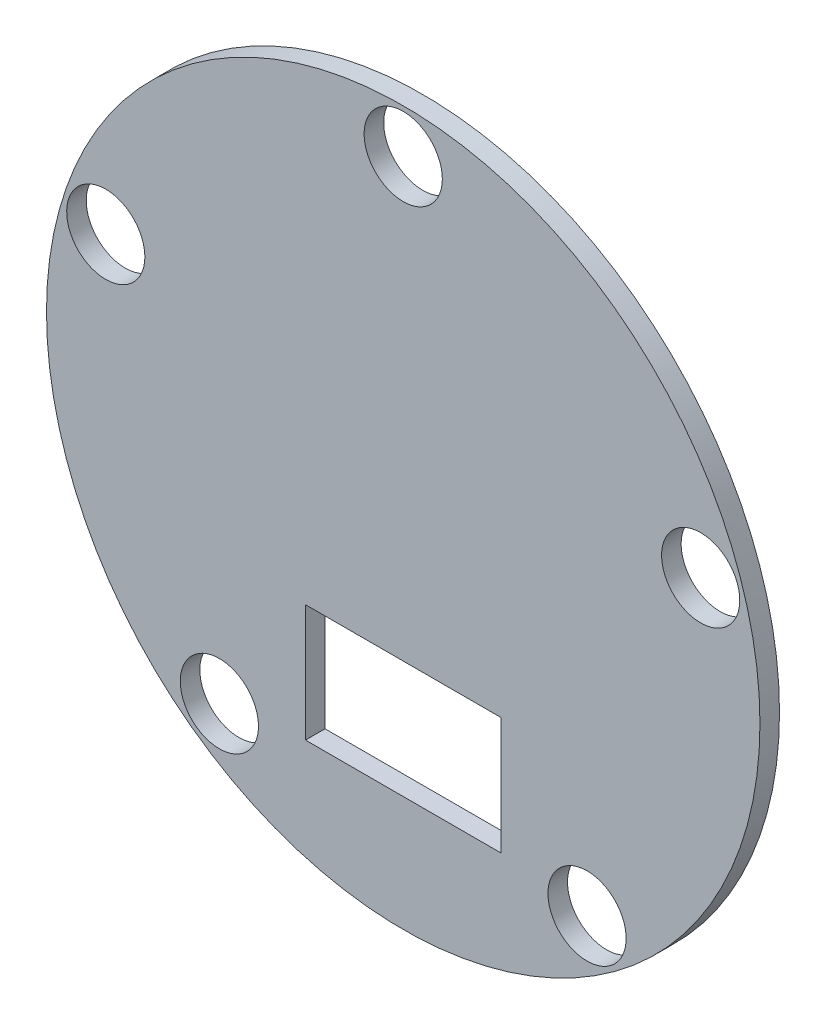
ISO-10303-21;
HEADER;
FILE_DESCRIPTION(('STEP AP214'),'2;1');
FILE_NAME('part.step','',(''),(''),'','','');
FILE_SCHEMA(('AUTOMOTIVE_DESIGN { 1 0 10303 214 1 1 1 1 }'));
ENDSEC;
DATA;
#1=APPLICATION_CONTEXT('core data for automotive mechanical design processes');
#2=APPLICATION_PROTOCOL_DEFINITION('international standard','automotive_design',2000,#1);
#3=PRODUCT_CONTEXT('',#1,'mechanical');
#4=PRODUCT('Part','Part','',(#3));
#5=PRODUCT_RELATED_PRODUCT_CATEGORY('part','',(#4));
#6=PRODUCT_DEFINITION_FORMATION('','',#4);
#7=PRODUCT_DEFINITION_CONTEXT('part definition',#1,'design');
#8=PRODUCT_DEFINITION('design','',#6,#7);
#9=PRODUCT_DEFINITION_SHAPE('','',#8);
#10=(LENGTH_UNIT() NAMED_UNIT(*) SI_UNIT(.MILLI.,.METRE.));
#11=(NAMED_UNIT(*) PLANE_ANGLE_UNIT() SI_UNIT($,.RADIAN.));
#12=(NAMED_UNIT(*) SI_UNIT($,.STERADIAN.) SOLID_ANGLE_UNIT());
#13=UNCERTAINTY_MEASURE_WITH_UNIT(LENGTH_MEASURE(1.E-05),#10,'distance_accuracy_value','');
#14=(GEOMETRIC_REPRESENTATION_CONTEXT(3) GLOBAL_UNCERTAINTY_ASSIGNED_CONTEXT((#13)) GLOBAL_UNIT_ASSIGNED_CONTEXT((#10,
#11,#12)) REPRESENTATION_CONTEXT('',''));
#15=CARTESIAN_POINT('',(0.,0.,0.));
#16=DIRECTION('',(0.,0.,1.));
#17=DIRECTION('',(1.,0.,0.));
#18=AXIS2_PLACEMENT_3D('',#15,#16,#17);
#19=CARTESIAN_POINT('',(0.,0.,6.35));
#20=DIRECTION('',(0.,0.,-1.));
#21=DIRECTION('',(-1.,0.,0.));
#22=AXIS2_PLACEMENT_3D('',#19,#20,#21);
#23=CYLINDRICAL_SURFACE('',#22,115.8875);
#24=CARTESIAN_POINT('',(0.,0.,6.35));
#25=DIRECTION('',(0.,0.,1.));
#26=DIRECTION('',(1.,0.,0.));
#27=AXIS2_PLACEMENT_3D('',#24,#25,#26);
#28=CIRCLE('',#27,115.8875);
#29=CARTESIAN_POINT('',(115.8875,0.,6.35));
#30=VERTEX_POINT('',#29);
#31=EDGE_CURVE('E13',#30,#30,#28,.T.);
#32=ORIENTED_EDGE('',*,*,#31,.F.);
#33=EDGE_LOOP('',(#32));
#34=FACE_BOUND('',#33,.T.);
#35=CARTESIAN_POINT('',(0.,0.,0.));
#36=DIRECTION('',(0.,0.,1.));
#37=DIRECTION('',(1.,0.,0.));
#38=AXIS2_PLACEMENT_3D('',#35,#36,#37);
#39=CIRCLE('',#38,115.8875);
#40=CARTESIAN_POINT('',(115.8875,0.,0.));
#41=VERTEX_POINT('',#40);
#42=EDGE_CURVE('E53',#41,#41,#39,.T.);
#43=ORIENTED_EDGE('',*,*,#42,.T.);
#44=EDGE_LOOP('',(#43));
#45=FACE_BOUND('',#44,.T.);
#46=ADVANCED_FACE('F50',(#34,#45),#23,.T.);
#47=CARTESIAN_POINT('',(0.,0.,6.35));
#48=DIRECTION('',(0.,0.,1.));
#49=DIRECTION('',(1.,0.,0.));
#50=AXIS2_PLACEMENT_3D('',#47,#48,#49);
#51=PLANE('',#50);
#52=DIRECTION('',(0.,-1.,0.));
#53=VECTOR('',#52,1.);
#54=CARTESIAN_POINT('',(-31.75,-40.3542301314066,6.35));
#55=LINE('',#54,#53);
#56=CARTESIAN_POINT('',(-31.75,-40.3542301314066,6.35));
#57=VERTEX_POINT('',#56);
#58=CARTESIAN_POINT('',(-31.75,-78.4542301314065,6.35));
#59=VERTEX_POINT('',#58);
#60=EDGE_CURVE('E68',#57,#59,#55,.T.);
#61=ORIENTED_EDGE('',*,*,#60,.F.);
#62=DIRECTION('',(-1.,0.,0.));
#63=VECTOR('',#62,1.);
#64=CARTESIAN_POINT('',(-31.75,-40.3542301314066,6.35));
#65=LINE('',#64,#63);
#66=CARTESIAN_POINT('',(31.75,-40.3542301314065,6.35));
#67=VERTEX_POINT('',#66);
#68=EDGE_CURVE('E118',#67,#57,#65,.T.);
#69=ORIENTED_EDGE('',*,*,#68,.F.);
#70=DIRECTION('',(0.,1.,0.));
#71=VECTOR('',#70,1.);
#72=CARTESIAN_POINT('',(31.75,-40.3542301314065,6.35));
#73=LINE('',#72,#71);
#74=CARTESIAN_POINT('',(31.75,-78.4542301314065,6.35));
#75=VERTEX_POINT('',#74);
#76=EDGE_CURVE('E123',#75,#67,#73,.T.);
#77=ORIENTED_EDGE('',*,*,#76,.F.);
#78=DIRECTION('',(1.,0.,0.));
#79=VECTOR('',#78,1.);
#80=CARTESIAN_POINT('',(-31.75,-78.4542301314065,6.35));
#81=LINE('',#80,#79);
#82=EDGE_CURVE('E131',#59,#75,#81,.T.);
#83=ORIENTED_EDGE('',*,*,#82,.F.);
#84=EDGE_LOOP('',(#61,#69,#77,#83));
#85=FACE_BOUND('',#84,.T.);
#86=CARTESIAN_POINT('',(-96.6273420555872,31.3961266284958,6.35));
#87=DIRECTION('',(0.,0.,1.));
#88=DIRECTION('',(0.309016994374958,0.95105651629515,0.));
#89=AXIS2_PLACEMENT_3D('',#86,#87,#88);
#90=CIRCLE('',#89,12.7);
#91=CARTESIAN_POINT('',(-92.7028262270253,43.4745443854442,6.35));
#92=VERTEX_POINT('',#91);
#93=EDGE_CURVE('E139',#92,#92,#90,.T.);
#94=ORIENTED_EDGE('',*,*,#93,.F.);
#95=EDGE_LOOP('',(#94));
#96=FACE_BOUND('',#95,.T.);
#97=CARTESIAN_POINT('',(-59.718981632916,-82.1961266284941,6.35));
#98=DIRECTION('',(0.,0.,1.));
#99=DIRECTION('',(-0.809016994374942,0.58778525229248,0.));
#100=AXIS2_PLACEMENT_3D('',#97,#98,#99);
#101=CIRCLE('',#100,12.7);
#102=CARTESIAN_POINT('',(-69.9934974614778,-74.7312539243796,6.35));
#103=VERTEX_POINT('',#102);
#104=EDGE_CURVE('E148',#103,#103,#101,.T.);
#105=ORIENTED_EDGE('',*,*,#104,.F.);
#106=EDGE_LOOP('',(#105));
#107=FACE_BOUND('',#106,.T.);
#108=CARTESIAN_POINT('',(59.7189816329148,-82.196126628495,6.35));
#109=DIRECTION('',(0.,0.,1.));
#110=DIRECTION('',(-0.809016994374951,-0.587785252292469,0.));
#111=AXIS2_PLACEMENT_3D('',#108,#109,#110);
#112=CIRCLE('',#111,12.7);
#113=CARTESIAN_POINT('',(49.4444658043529,-89.6609993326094,6.35));
#114=VERTEX_POINT('',#113);
#115=EDGE_CURVE('E155',#114,#114,#112,.T.);
#116=ORIENTED_EDGE('',*,*,#115,.F.);
#117=EDGE_LOOP('',(#116));
#118=FACE_BOUND('',#117,.T.);
#119=CARTESIAN_POINT('',(96.6273420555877,31.3961266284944,6.35));
#120=DIRECTION('',(0.,0.,1.));
#121=DIRECTION('',(0.309016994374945,-0.951056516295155,0.));
#122=AXIS2_PLACEMENT_3D('',#119,#120,#121);
#123=CIRCLE('',#122,12.7);
#124=CARTESIAN_POINT('',(100.55185788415,19.3177088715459,6.35));
#125=VERTEX_POINT('',#124);
#126=EDGE_CURVE('E163',#125,#125,#123,.T.);
#127=ORIENTED_EDGE('',*,*,#126,.F.);
#128=EDGE_LOOP('',(#127));
#129=FACE_BOUND('',#128,.T.);
#130=CARTESIAN_POINT('',(0.,101.6,6.35));
#131=DIRECTION('',(0.,0.,1.));
#132=DIRECTION('',(1.,0.,0.));
#133=AXIS2_PLACEMENT_3D('',#130,#131,#132);
#134=CIRCLE('',#133,12.7);
#135=CARTESIAN_POINT('',(12.7,101.6,6.35));
#136=VERTEX_POINT('',#135);
#137=EDGE_CURVE('E170',#136,#136,#134,.T.);
#138=ORIENTED_EDGE('',*,*,#137,.F.);
#139=EDGE_LOOP('',(#138));
#140=FACE_BOUND('',#139,.T.);
#141=ORIENTED_EDGE('',*,*,#31,.T.);
#142=EDGE_LOOP('',(#141));
#143=FACE_BOUND('',#142,.T.);
#144=ADVANCED_FACE('F181',(#85,#96,#107,#118,#129,#140,#143),#51,.T.);
#145=CARTESIAN_POINT('',(0.,0.,0.));
#146=DIRECTION('',(0.,0.,1.));
#147=DIRECTION('',(1.,0.,0.));
#148=AXIS2_PLACEMENT_3D('',#145,#146,#147);
#149=PLANE('',#148);
#150=DIRECTION('',(-1.,0.,0.));
#151=VECTOR('',#150,1.);
#152=CARTESIAN_POINT('',(-31.75,-40.3542301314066,0.));
#153=LINE('',#152,#151);
#154=CARTESIAN_POINT('',(31.75,-40.3542301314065,0.));
#155=VERTEX_POINT('',#154);
#156=CARTESIAN_POINT('',(-31.75,-40.3542301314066,0.));
#157=VERTEX_POINT('',#156);
#158=EDGE_CURVE('E106',#155,#157,#153,.T.);
#159=ORIENTED_EDGE('',*,*,#158,.T.);
#160=DIRECTION('',(0.,-1.,0.));
#161=VECTOR('',#160,1.);
#162=CARTESIAN_POINT('',(-31.75,-40.3542301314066,0.));
#163=LINE('',#162,#161);
#164=CARTESIAN_POINT('',(-31.75,-78.4542301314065,0.));
#165=VERTEX_POINT('',#164);
#166=EDGE_CURVE('E99',#157,#165,#163,.T.);
#167=ORIENTED_EDGE('',*,*,#166,.T.);
#168=DIRECTION('',(1.,0.,0.));
#169=VECTOR('',#168,1.);
#170=CARTESIAN_POINT('',(-31.75,-78.4542301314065,0.));
#171=LINE('',#170,#169);
#172=CARTESIAN_POINT('',(31.75,-78.4542301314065,0.));
#173=VERTEX_POINT('',#172);
#174=EDGE_CURVE('E109',#165,#173,#171,.T.);
#175=ORIENTED_EDGE('',*,*,#174,.T.);
#176=DIRECTION('',(0.,1.,0.));
#177=VECTOR('',#176,1.);
#178=CARTESIAN_POINT('',(31.75,-40.3542301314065,0.));
#179=LINE('',#178,#177);
#180=EDGE_CURVE('E78',#173,#155,#179,.T.);
#181=ORIENTED_EDGE('',*,*,#180,.T.);
#182=EDGE_LOOP('',(#159,#167,#175,#181));
#183=FACE_BOUND('',#182,.T.);
#184=CARTESIAN_POINT('',(-96.6273420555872,31.3961266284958,0.));
#185=DIRECTION('',(0.,0.,1.));
#186=DIRECTION('',(0.309016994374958,0.95105651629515,0.));
#187=AXIS2_PLACEMENT_3D('',#184,#185,#186);
#188=CIRCLE('',#187,12.7);
#189=CARTESIAN_POINT('',(-92.7028262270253,43.4745443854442,0.));
#190=VERTEX_POINT('',#189);
#191=EDGE_CURVE('E145',#190,#190,#188,.T.);
#192=ORIENTED_EDGE('',*,*,#191,.T.);
#193=EDGE_LOOP('',(#192));
#194=FACE_BOUND('',#193,.T.);
#195=CARTESIAN_POINT('',(-59.718981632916,-82.1961266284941,0.));
#196=DIRECTION('',(0.,0.,1.));
#197=DIRECTION('',(-0.809016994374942,0.58778525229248,0.));
#198=AXIS2_PLACEMENT_3D('',#195,#196,#197);
#199=CIRCLE('',#198,12.7);
#200=CARTESIAN_POINT('',(-69.9934974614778,-74.7312539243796,0.));
#201=VERTEX_POINT('',#200);
#202=EDGE_CURVE('E151',#201,#201,#199,.T.);
#203=ORIENTED_EDGE('',*,*,#202,.T.);
#204=EDGE_LOOP('',(#203));
#205=FACE_BOUND('',#204,.T.);
#206=CARTESIAN_POINT('',(59.7189816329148,-82.196126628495,0.));
#207=DIRECTION('',(0.,0.,1.));
#208=DIRECTION('',(-0.809016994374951,-0.587785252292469,0.));
#209=AXIS2_PLACEMENT_3D('',#206,#207,#208);
#210=CIRCLE('',#209,12.7);
#211=CARTESIAN_POINT('',(49.4444658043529,-89.6609993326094,0.));
#212=VERTEX_POINT('',#211);
#213=EDGE_CURVE('E159',#212,#212,#210,.T.);
#214=ORIENTED_EDGE('',*,*,#213,.T.);
#215=EDGE_LOOP('',(#214));
#216=FACE_BOUND('',#215,.T.);
#217=CARTESIAN_POINT('',(96.6273420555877,31.3961266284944,0.));
#218=DIRECTION('',(0.,0.,1.));
#219=DIRECTION('',(0.309016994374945,-0.951056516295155,0.));
#220=AXIS2_PLACEMENT_3D('',#217,#218,#219);
#221=CIRCLE('',#220,12.7);
#222=CARTESIAN_POINT('',(100.55185788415,19.3177088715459,0.));
#223=VERTEX_POINT('',#222);
#224=EDGE_CURVE('E167',#223,#223,#221,.T.);
#225=ORIENTED_EDGE('',*,*,#224,.T.);
#226=EDGE_LOOP('',(#225));
#227=FACE_BOUND('',#226,.T.);
#228=CARTESIAN_POINT('',(0.,101.6,0.));
#229=DIRECTION('',(0.,0.,1.));
#230=DIRECTION('',(1.,0.,0.));
#231=AXIS2_PLACEMENT_3D('',#228,#229,#230);
#232=CIRCLE('',#231,12.7);
#233=CARTESIAN_POINT('',(12.7,101.6,0.));
#234=VERTEX_POINT('',#233);
#235=EDGE_CURVE('E173',#234,#234,#232,.T.);
#236=ORIENTED_EDGE('',*,*,#235,.T.);
#237=EDGE_LOOP('',(#236));
#238=FACE_BOUND('',#237,.T.);
#239=ORIENTED_EDGE('',*,*,#42,.F.);
#240=EDGE_LOOP('',(#239));
#241=FACE_BOUND('',#240,.T.);
#242=ADVANCED_FACE('F114',(#183,#194,#205,#216,#227,#238,#241),#149,.F.);
#243=CARTESIAN_POINT('',(0.,101.6,0.));
#244=DIRECTION('',(0.,0.,1.));
#245=DIRECTION('',(1.,0.,0.));
#246=AXIS2_PLACEMENT_3D('',#243,#244,#245);
#247=CYLINDRICAL_SURFACE('',#246,12.7);
#248=ORIENTED_EDGE('',*,*,#235,.F.);
#249=EDGE_LOOP('',(#248));
#250=FACE_BOUND('',#249,.T.);
#251=ORIENTED_EDGE('',*,*,#137,.T.);
#252=EDGE_LOOP('',(#251));
#253=FACE_BOUND('',#252,.T.);
#254=ADVANCED_FACE('F179',(#250,#253),#247,.F.);
#255=CARTESIAN_POINT('',(96.6273420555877,31.3961266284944,0.));
#256=DIRECTION('',(0.,0.,1.));
#257=DIRECTION('',(1.,0.,0.));
#258=AXIS2_PLACEMENT_3D('',#255,#256,#257);
#259=CYLINDRICAL_SURFACE('',#258,12.7);
#260=ORIENTED_EDGE('',*,*,#224,.F.);
#261=EDGE_LOOP('',(#260));
#262=FACE_BOUND('',#261,.T.);
#263=ORIENTED_EDGE('',*,*,#126,.T.);
#264=EDGE_LOOP('',(#263));
#265=FACE_BOUND('',#264,.T.);
#266=ADVANCED_FACE('F197',(#262,#265),#259,.F.);
#267=CARTESIAN_POINT('',(59.7189816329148,-82.196126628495,0.));
#268=DIRECTION('',(0.,0.,1.));
#269=DIRECTION('',(1.,0.,0.));
#270=AXIS2_PLACEMENT_3D('',#267,#268,#269);
#271=CYLINDRICAL_SURFACE('',#270,12.7);
#272=ORIENTED_EDGE('',*,*,#213,.F.);
#273=EDGE_LOOP('',(#272));
#274=FACE_BOUND('',#273,.T.);
#275=ORIENTED_EDGE('',*,*,#115,.T.);
#276=EDGE_LOOP('',(#275));
#277=FACE_BOUND('',#276,.T.);
#278=ADVANCED_FACE('F203',(#274,#277),#271,.F.);
#279=CARTESIAN_POINT('',(-59.718981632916,-82.1961266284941,0.));
#280=DIRECTION('',(0.,0.,1.));
#281=DIRECTION('',(1.,0.,0.));
#282=AXIS2_PLACEMENT_3D('',#279,#280,#281);
#283=CYLINDRICAL_SURFACE('',#282,12.7);
#284=ORIENTED_EDGE('',*,*,#202,.F.);
#285=EDGE_LOOP('',(#284));
#286=FACE_BOUND('',#285,.T.);
#287=ORIENTED_EDGE('',*,*,#104,.T.);
#288=EDGE_LOOP('',(#287));
#289=FACE_BOUND('',#288,.T.);
#290=ADVANCED_FACE('F207',(#286,#289),#283,.F.);
#291=CARTESIAN_POINT('',(-96.6273420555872,31.3961266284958,0.));
#292=DIRECTION('',(0.,0.,1.));
#293=DIRECTION('',(1.,0.,0.));
#294=AXIS2_PLACEMENT_3D('',#291,#292,#293);
#295=CYLINDRICAL_SURFACE('',#294,12.7);
#296=ORIENTED_EDGE('',*,*,#191,.F.);
#297=EDGE_LOOP('',(#296));
#298=FACE_BOUND('',#297,.T.);
#299=ORIENTED_EDGE('',*,*,#93,.T.);
#300=EDGE_LOOP('',(#299));
#301=FACE_BOUND('',#300,.T.);
#302=ADVANCED_FACE('F211',(#298,#301),#295,.F.);
#303=CARTESIAN_POINT('',(-31.75,-40.3542301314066,0.));
#304=DIRECTION('',(-1.,0.,0.));
#305=DIRECTION('',(0.,-1.,0.));
#306=AXIS2_PLACEMENT_3D('',#303,#304,#305);
#307=PLANE('',#306);
#308=ORIENTED_EDGE('',*,*,#60,.T.);
#309=DIRECTION('',(0.,0.,1.));
#310=VECTOR('',#309,1.);
#311=CARTESIAN_POINT('',(-31.75,-78.4542301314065,0.));
#312=LINE('',#311,#310);
#313=EDGE_CURVE('E95',#165,#59,#312,.T.);
#314=ORIENTED_EDGE('',*,*,#313,.F.);
#315=ORIENTED_EDGE('',*,*,#166,.F.);
#316=DIRECTION('',(0.,0.,1.));
#317=VECTOR('',#316,1.);
#318=CARTESIAN_POINT('',(-31.75,-40.3542301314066,0.));
#319=LINE('',#318,#317);
#320=EDGE_CURVE('E137',#157,#57,#319,.T.);
#321=ORIENTED_EDGE('',*,*,#320,.T.);
#322=EDGE_LOOP('',(#308,#314,#315,#321));
#323=FACE_BOUND('',#322,.T.);
#324=ADVANCED_FACE('F97',(#323),#307,.F.);
#325=CARTESIAN_POINT('',(-31.75,-40.3542301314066,0.));
#326=DIRECTION('',(0.,1.,0.));
#327=DIRECTION('',(-1.,0.,0.));
#328=AXIS2_PLACEMENT_3D('',#325,#326,#327);
#329=PLANE('',#328);
#330=ORIENTED_EDGE('',*,*,#68,.T.);
#331=ORIENTED_EDGE('',*,*,#320,.F.);
#332=ORIENTED_EDGE('',*,*,#158,.F.);
#333=DIRECTION('',(0.,0.,1.));
#334=VECTOR('',#333,1.);
#335=CARTESIAN_POINT('',(31.75,-40.3542301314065,0.));
#336=LINE('',#335,#334);
#337=EDGE_CURVE('E140',#155,#67,#336,.T.);
#338=ORIENTED_EDGE('',*,*,#337,.T.);
#339=EDGE_LOOP('',(#330,#331,#332,#338));
#340=FACE_BOUND('',#339,.T.);
#341=ADVANCED_FACE('F218',(#340),#329,.F.);
#342=CARTESIAN_POINT('',(31.75,-40.3542301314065,0.));
#343=DIRECTION('',(1.,0.,0.));
#344=DIRECTION('',(0.,1.,0.));
#345=AXIS2_PLACEMENT_3D('',#342,#343,#344);
#346=PLANE('',#345);
#347=ORIENTED_EDGE('',*,*,#76,.T.);
#348=ORIENTED_EDGE('',*,*,#337,.F.);
#349=ORIENTED_EDGE('',*,*,#180,.F.);
#350=DIRECTION('',(0.,0.,1.));
#351=VECTOR('',#350,1.);
#352=CARTESIAN_POINT('',(31.75,-78.4542301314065,0.));
#353=LINE('',#352,#351);
#354=EDGE_CURVE('E105',#173,#75,#353,.T.);
#355=ORIENTED_EDGE('',*,*,#354,.T.);
#356=EDGE_LOOP('',(#347,#348,#349,#355));
#357=FACE_BOUND('',#356,.T.);
#358=ADVANCED_FACE('F221',(#357),#346,.F.);
#359=CARTESIAN_POINT('',(-31.75,-78.4542301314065,0.));
#360=DIRECTION('',(0.,-1.,0.));
#361=DIRECTION('',(0.,0.,-1.));
#362=AXIS2_PLACEMENT_3D('',#359,#360,#361);
#363=PLANE('',#362);
#364=ORIENTED_EDGE('',*,*,#82,.T.);
#365=ORIENTED_EDGE('',*,*,#354,.F.);
#366=ORIENTED_EDGE('',*,*,#174,.F.);
#367=ORIENTED_EDGE('',*,*,#313,.T.);
#368=EDGE_LOOP('',(#364,#365,#366,#367));
#369=FACE_BOUND('',#368,.T.);
#370=ADVANCED_FACE('F110',(#369),#363,.F.);
#371=CLOSED_SHELL('',(#46,#144,#242,#254,#266,#278,#290,#302,#324,#341,#358,#370));
#372=MANIFOLD_SOLID_BREP('B2',#371);
#373=ADVANCED_BREP_SHAPE_REPRESENTATION('',(#18,#372),#14);
#374=SHAPE_DEFINITION_REPRESENTATION(#9,#373);
ENDSEC;
END-ISO-10303-21;
